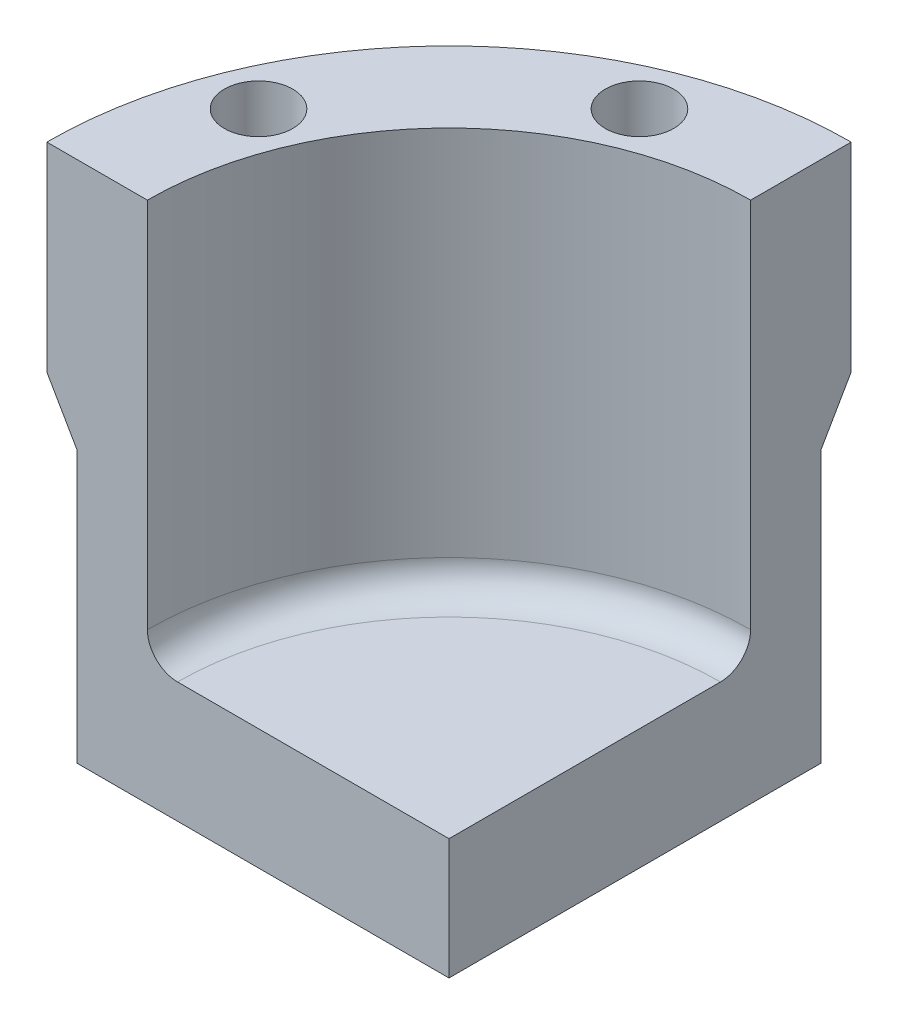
from build123d import *

# Parameters (mm, degrees)
ROTATION1_ANGLE          = 90
M8_GEWINDEBOHRUNG1_D     = 6.8
M8_GEWINDEBOHRUNG1_DEPTH = 22.25
M8_GEWINDEBOHRUNG1_TIP   = 2.042926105
VERRUNDUNG1_R            = 3


with BuildPart() as part:
    # Skizze1 → Rotation1 (revolve)
    with BuildSketch(Plane.XY):
        Polygon((0, 0), (-30, 0), (-30, 40), (-40, 40), (-40, 20.196152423), (-37, 15), (-37, -12), (0, -12), align=None)
    revolve(axis=Axis((0, 25.481436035, 0), (0, -1, 0)), revolution_arc=ROTATION1_ANGLE)

    # M8 Gewindebohrung1
    with Locations(Plane(origin=(0, 40, 0), x_dir=(1, 0, 0), z_dir=(0, 1, 0))):
        with Locations((-32.335783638, 13.393920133), (-13.393920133, 32.335783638)):
            Hole(M8_GEWINDEBOHRUNG1_D / 2, depth=M8_GEWINDEBOHRUNG1_DEPTH)
            with Locations((0, 0, -(M8_GEWINDEBOHRUNG1_DEPTH + M8_GEWINDEBOHRUNG1_TIP / 2))):  # 118° drill point
                Cone(0, M8_GEWINDEBOHRUNG1_D / 2, M8_GEWINDEBOHRUNG1_TIP, mode=Mode.SUBTRACT)

    # Verrundung1
    verrundung1_edges = [part.edges().sort_by_distance(p)[0] for p in [
        (-21.213203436, 0, -21.213203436),
    ]]
    fillet(verrundung1_edges, radius=VERRUNDUNG1_R)


solid = part.part
